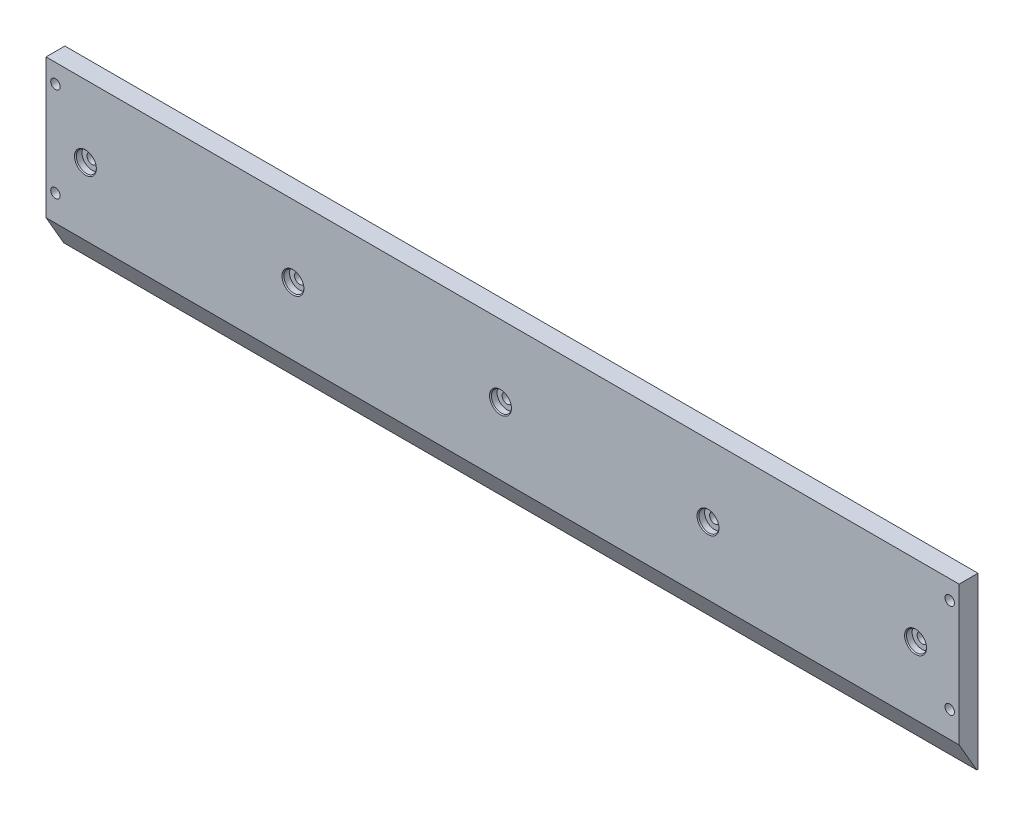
from build123d import *

# Parameters (mm, degrees)
BOSS_EXTRUDE1_DEPTH = 307.34
SKETCH2_R           = 3.175
CUT_EXTRUDE1_DEPTH  = 87.63
LPATTERN1_COUNT     = 5
LPATTERN1_PITCH     = 139.7


with BuildPart() as part:
    # Sketch1 → Boss-Extrude1 (new, symmetric)
    with BuildSketch(Plane(origin=(0, 0, 0), x_dir=(0, 0, -1), z_dir=(1, 0, 0))):
        Polygon((0, 0), (-0.821595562, 0), (-12.7, 20.574), (-12.7, 114.3), (0, 114.3), align=None)
    extrude(amount=BOSS_EXTRUDE1_DEPTH, both=True)

    # Sketch2 → Cut-Extrude1 (cut)
    with BuildSketch(Plane.XY.offset(12.7)):
        with Locations((-300.99, 101.6)):
            Circle(SKETCH2_R)
        with Locations((-300.99, 38.1)):
            Circle(SKETCH2_R)
        with Locations((300.99, 38.1)):
            Circle(SKETCH2_R)
        with Locations((300.99, 101.6)):
            Circle(SKETCH2_R)
    extrude(amount=-CUT_EXTRUDE1_DEPTH, mode=Mode.SUBTRACT)

    # Sketch5 → CBORE for 1_4 Pan Head Machine Screw1 (revolve, cut)
    with BuildSketch(Plane(origin=(-280.797, 66.04, 12.7), x_dir=(0, -1, 0), z_dir=(1, 0, 0))):
        Polygon((0, 0), (0, 12.7), (3.3782, 12.7), (3.3782, 4.445), (6.74624, 4.445), (6.74624, 0.635), (7.38124, 0), align=None)
    cbore_for_1_4_pan_head_machine_screw1 = revolve(axis=Axis((-280.797, 66.04, 19.05), (0, 0, -1)), mode=Mode.SUBTRACT)

    # LPattern1: CBORE for 1_4 Pan Head Machine Screw1 ×5
    with Locations(*[(i * LPATTERN1_PITCH, 0, 0) for i in range(1, LPATTERN1_COUNT)]):
        add(cbore_for_1_4_pan_head_machine_screw1, mode=Mode.SUBTRACT)


solid = part.part
